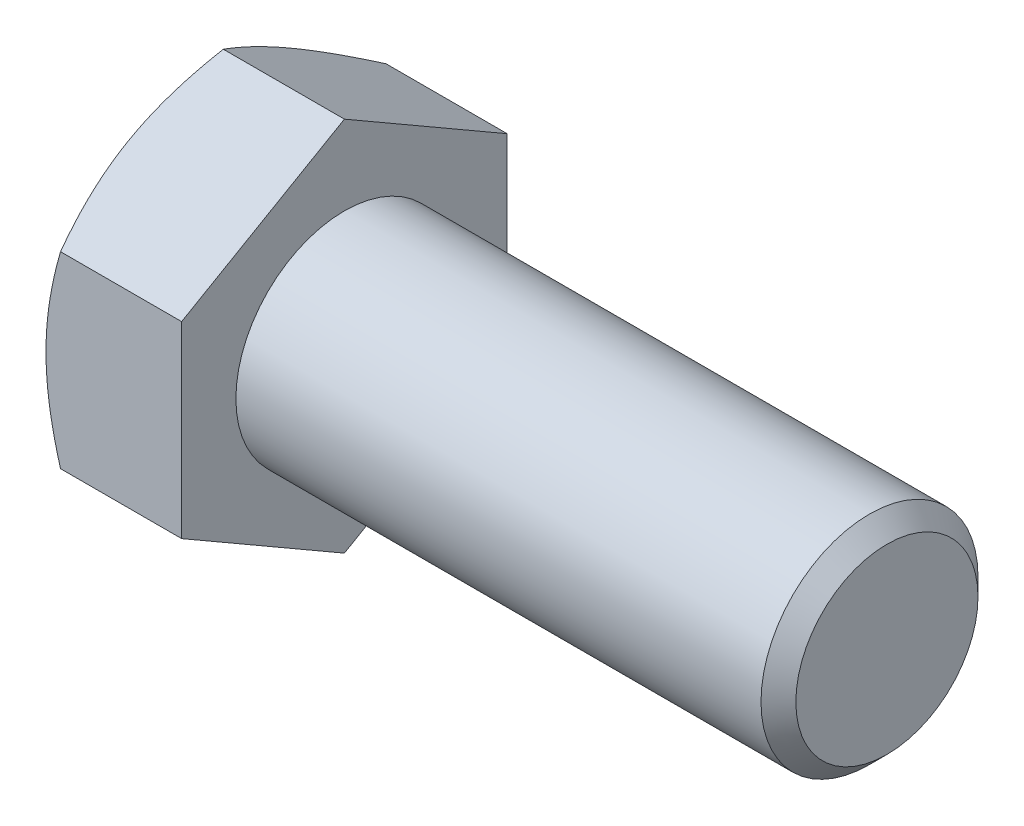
ISO-10303-21;
HEADER;
FILE_DESCRIPTION(('STEP AP214'),'2;1');
FILE_NAME('part.step','',(''),(''),'','','');
FILE_SCHEMA(('AUTOMOTIVE_DESIGN { 1 0 10303 214 1 1 1 1 }'));
ENDSEC;
DATA;
#1=APPLICATION_CONTEXT('core data for automotive mechanical design processes');
#2=APPLICATION_PROTOCOL_DEFINITION('international standard','automotive_design',2000,#1);
#3=PRODUCT_CONTEXT('',#1,'mechanical');
#4=PRODUCT('Part','Part','',(#3));
#5=PRODUCT_RELATED_PRODUCT_CATEGORY('part','',(#4));
#6=PRODUCT_DEFINITION_FORMATION('','',#4);
#7=PRODUCT_DEFINITION_CONTEXT('part definition',#1,'design');
#8=PRODUCT_DEFINITION('design','',#6,#7);
#9=PRODUCT_DEFINITION_SHAPE('','',#8);
#10=(LENGTH_UNIT() NAMED_UNIT(*) SI_UNIT(.MILLI.,.METRE.));
#11=(NAMED_UNIT(*) PLANE_ANGLE_UNIT() SI_UNIT($,.RADIAN.));
#12=(NAMED_UNIT(*) SI_UNIT($,.STERADIAN.) SOLID_ANGLE_UNIT());
#13=UNCERTAINTY_MEASURE_WITH_UNIT(LENGTH_MEASURE(1.E-05),#10,'distance_accuracy_value','');
#14=(GEOMETRIC_REPRESENTATION_CONTEXT(3) GLOBAL_UNCERTAINTY_ASSIGNED_CONTEXT((#13)) GLOBAL_UNIT_ASSIGNED_CONTEXT((#10,
#11,#12)) REPRESENTATION_CONTEXT('',''));
#15=CARTESIAN_POINT('',(0.,0.,0.));
#16=DIRECTION('',(0.,0.,1.));
#17=DIRECTION('',(1.,0.,0.));
#18=AXIS2_PLACEMENT_3D('',#15,#16,#17);
#19=CARTESIAN_POINT('',(0.,10.392304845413,0.));
#20=DIRECTION('',(1.,0.,0.));
#21=DIRECTION('',(0.,1.,0.));
#22=AXIS2_PLACEMENT_3D('',#19,#20,#21);
#23=PLANE('',#22);
#24=CARTESIAN_POINT('',(1.11022302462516E-13,0.,0.));
#25=DIRECTION('',(1.,0.,0.));
#26=DIRECTION('',(0.,1.,0.));
#27=AXIS2_PLACEMENT_3D('',#24,#25,#26);
#28=CIRCLE('',#27,9.00000000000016);
#29=CARTESIAN_POINT('',(0.,-7.79422863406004,-4.49999999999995));
#30=VERTEX_POINT('',#29);
#31=CARTESIAN_POINT('',(0.,0.,-9.00000000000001));
#32=VERTEX_POINT('',#31);
#33=EDGE_CURVE('E339',#30,#32,#28,.T.);
#34=ORIENTED_EDGE('',*,*,#33,.F.);
#35=CARTESIAN_POINT('',(0.,0.,0.));
#36=DIRECTION('',(1.,0.,0.));
#37=DIRECTION('',(0.,1.,0.));
#38=AXIS2_PLACEMENT_3D('',#35,#36,#37);
#39=CIRCLE('',#38,9.00000000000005);
#40=CARTESIAN_POINT('',(0.,-7.79422863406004,4.49999999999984));
#41=VERTEX_POINT('',#40);
#42=EDGE_CURVE('E338',#41,#30,#39,.T.);
#43=ORIENTED_EDGE('',*,*,#42,.F.);
#44=CARTESIAN_POINT('',(0.,0.,0.));
#45=DIRECTION('',(1.,0.,0.));
#46=DIRECTION('',(0.,1.,0.));
#47=AXIS2_PLACEMENT_3D('',#44,#45,#46);
#48=CIRCLE('',#47,9.00000000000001);
#49=CARTESIAN_POINT('',(-1.11022302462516E-13,-1.66533453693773E-13,8.99999999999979));
#50=VERTEX_POINT('',#49);
#51=EDGE_CURVE('E88',#50,#41,#48,.T.);
#52=ORIENTED_EDGE('',*,*,#51,.F.);
#53=CARTESIAN_POINT('',(-1.11022302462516E-13,0.,0.));
#54=DIRECTION('',(1.,0.,0.));
#55=DIRECTION('',(0.,1.,0.));
#56=AXIS2_PLACEMENT_3D('',#53,#54,#55);
#57=CIRCLE('',#56,8.9999999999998);
#58=CARTESIAN_POINT('',(-1.11022302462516E-13,7.79422863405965,4.49999999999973));
#59=VERTEX_POINT('',#58);
#60=EDGE_CURVE('E86',#59,#50,#57,.T.);
#61=ORIENTED_EDGE('',*,*,#60,.F.);
#62=CARTESIAN_POINT('',(0.,0.,0.));
#63=DIRECTION('',(1.,0.,0.));
#64=DIRECTION('',(0.,1.,0.));
#65=AXIS2_PLACEMENT_3D('',#62,#63,#64);
#66=CIRCLE('',#65,9.00000000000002);
#67=CARTESIAN_POINT('',(0.,7.79422863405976,-4.49999999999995));
#68=VERTEX_POINT('',#67);
#69=EDGE_CURVE('E19',#68,#59,#66,.T.);
#70=ORIENTED_EDGE('',*,*,#69,.F.);
#71=CARTESIAN_POINT('',(0.,0.,0.));
#72=DIRECTION('',(1.,0.,0.));
#73=DIRECTION('',(0.,1.,0.));
#74=AXIS2_PLACEMENT_3D('',#71,#72,#73);
#75=CIRCLE('',#74,9.00000000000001);
#76=EDGE_CURVE('E264',#32,#68,#75,.T.);
#77=ORIENTED_EDGE('',*,*,#76,.F.);
#78=EDGE_LOOP('',(#34,#43,#52,#61,#70,#77));
#79=FACE_BOUND('',#78,.T.);
#80=ADVANCED_FACE('F16',(#79),#23,.F.);
#81=CARTESIAN_POINT('',(0.808670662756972,0.,0.));
#82=DIRECTION('',(1.,0.,0.));
#83=DIRECTION('',(0.,1.,0.));
#84=AXIS2_PLACEMENT_3D('',#81,#82,#83);
#85=CONICAL_SURFACE('',#84,10.4006586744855,1.0471975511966);
#86=CARTESIAN_POINT('',(0.803847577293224,10.3923048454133,-4.44089209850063E-13));
#87=CARTESIAN_POINT('',(0.681717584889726,10.1808225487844,-0.366298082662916));
#88=CARTESIAN_POINT('',(0.569825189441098,9.96764662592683,-0.735529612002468));
#89=CARTESIAN_POINT('',(0.372504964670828,9.53941565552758,-1.47724741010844));
#90=CARTESIAN_POINT('',(0.286946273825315,9.32437554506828,-1.84970780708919));
#91=CARTESIAN_POINT('',(0.181894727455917,8.99978592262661,-2.41191352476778));
#92=CARTESIAN_POINT('',(0.150745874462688,8.89117935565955,-2.60002561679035));
#93=CARTESIAN_POINT('',(0.0968265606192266,8.67344627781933,-2.97715037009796));
#94=CARTESIAN_POINT('',(0.0740558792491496,8.56431978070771,-3.1661630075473));
#95=CARTESIAN_POINT('',(0.0372929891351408,8.34514319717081,-3.54578798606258));
#96=CARTESIAN_POINT('',(0.0233454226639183,8.23509122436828,-3.73640359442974));
#97=CARTESIAN_POINT('',(0.00467962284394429,8.01477084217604,-4.1180096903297));
#98=CARTESIAN_POINT('',(-3.67826645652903E-05,7.90450239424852,-4.30900024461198));
#99=CARTESIAN_POINT('',(0.,7.7942286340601,-4.50000000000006));
#100=B_SPLINE_CURVE_WITH_KNOTS('',3,(#86,#87,#88,#89,#90,#91,#92,#93,#94,#95,#96,#97,#98,#99),
.UNSPECIFIED.,.F.,.F.,(4,2,2,2,2,2,4),(0.,1.32126598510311,2.63585597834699,3.29401348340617,
3.95215366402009,4.61359774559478,5.2751727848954),.UNSPECIFIED.);
#101=CARTESIAN_POINT('',(0.803847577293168,10.3923048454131,-2.22044604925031E-13));
#102=VERTEX_POINT('',#101);
#103=EDGE_CURVE('E98',#102,#68,#100,.T.);
#104=ORIENTED_EDGE('',*,*,#103,.T.);
#105=ORIENTED_EDGE('',*,*,#69,.T.);
#106=CARTESIAN_POINT('',(-1.66533453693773E-13,7.79422863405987,4.49999999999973));
#107=CARTESIAN_POINT('',(-3.67826647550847E-05,7.90450239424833,4.30900024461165));
#108=CARTESIAN_POINT('',(0.00467962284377,8.01477084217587,4.11800969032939));
#109=CARTESIAN_POINT('',(0.0233454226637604,8.23509122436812,3.73640359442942));
#110=CARTESIAN_POINT('',(0.0372929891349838,8.34514319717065,3.54578798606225));
#111=CARTESIAN_POINT('',(0.0740558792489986,8.56431978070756,3.16616300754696));
#112=CARTESIAN_POINT('',(0.0968265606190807,8.67344627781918,2.97715037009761));
#113=CARTESIAN_POINT('',(0.150745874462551,8.89117935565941,2.60002561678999));
#114=CARTESIAN_POINT('',(0.181894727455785,8.99978592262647,2.41191352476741));
#115=CARTESIAN_POINT('',(0.286946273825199,9.32437554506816,1.84970780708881));
#116=CARTESIAN_POINT('',(0.372504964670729,9.53941565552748,1.47724741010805));
#117=CARTESIAN_POINT('',(0.569825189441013,9.96764662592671,0.735529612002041));
#118=CARTESIAN_POINT('',(0.681717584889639,10.1808225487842,0.366298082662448));
#119=CARTESIAN_POINT('',(0.803847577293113,10.392304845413,-1.11022302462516E-13));
#120=B_SPLINE_CURVE_WITH_KNOTS('',3,(#106,#107,#108,#109,#110,#111,#112,#113,#114,#115,#116,
#117,#118,#119),.UNSPECIFIED.,.F.,.F.,(4,2,2,2,2,2,4),(0.,0.66157503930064,1.32301912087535,
1.98115930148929,2.63931680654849,3.95390679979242,5.27517278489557),.UNSPECIFIED.);
#121=EDGE_CURVE('E96',#59,#102,#120,.T.);
#122=ORIENTED_EDGE('',*,*,#121,.T.);
#123=EDGE_LOOP('',(#104,#105,#122));
#124=FACE_BOUND('',#123,.T.);
#125=ADVANCED_FACE('F94',(#124),#85,.T.);
#126=CARTESIAN_POINT('',(0.808670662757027,0.,0.));
#127=DIRECTION('',(1.,0.,0.));
#128=DIRECTION('',(0.,1.,0.));
#129=AXIS2_PLACEMENT_3D('',#126,#127,#128);
#130=CONICAL_SURFACE('',#129,10.4006586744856,1.0471975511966);
#131=CARTESIAN_POINT('',(0.803847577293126,5.19615242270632,8.99999999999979));
#132=CARTESIAN_POINT('',(0.681717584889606,5.40763471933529,8.63370191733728));
#133=CARTESIAN_POINT('',(0.569825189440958,5.62081064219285,8.26447038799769));
#134=CARTESIAN_POINT('',(0.372504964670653,6.04904161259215,7.52275258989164));
#135=CARTESIAN_POINT('',(0.286946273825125,6.26408172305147,7.15029219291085));
#136=CARTESIAN_POINT('',(0.181894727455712,6.58867134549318,6.5880864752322));
#137=CARTESIAN_POINT('',(0.150745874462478,6.69727791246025,6.39997438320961));
#138=CARTESIAN_POINT('',(0.0968265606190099,6.9150109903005,6.02284962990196));
#139=CARTESIAN_POINT('',(0.0740558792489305,7.02413748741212,5.8338369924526));
#140=CARTESIAN_POINT('',(0.0372929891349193,7.24331407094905,5.45421201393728));
#141=CARTESIAN_POINT('',(0.0233454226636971,7.35336604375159,5.2635964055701));
#142=CARTESIAN_POINT('',(0.00467962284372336,7.57368642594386,4.8819903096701));
#143=CARTESIAN_POINT('',(-3.67826647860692E-05,7.68395487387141,4.69099975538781));
#144=CARTESIAN_POINT('',(-1.66533453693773E-13,7.79422863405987,4.49999999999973));
#145=B_SPLINE_CURVE_WITH_KNOTS('',3,(#131,#132,#133,#134,#135,#136,#137,#138,#139,#140,#141,
#142,#143,#144),.UNSPECIFIED.,.F.,.F.,(4,2,2,2,2,2,4),(0.,1.32126598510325,2.63585597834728,
3.29401348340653,3.95215366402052,4.61359774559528,5.27517278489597),.UNSPECIFIED.);
#146=CARTESIAN_POINT('',(0.803847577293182,5.19615242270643,9.00000000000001));
#147=VERTEX_POINT('',#146);
#148=EDGE_CURVE('E101',#147,#59,#145,.T.);
#149=ORIENTED_EDGE('',*,*,#148,.T.);
#150=ORIENTED_EDGE('',*,*,#60,.T.);
#151=CARTESIAN_POINT('',(0.,-1.66533453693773E-13,8.99999999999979));
#152=CARTESIAN_POINT('',(-3.6782664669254E-05,0.220547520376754,8.99999999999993));
#153=CARTESIAN_POINT('',(0.00467962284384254,0.441084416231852,8.99999999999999));
#154=CARTESIAN_POINT('',(0.0233454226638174,0.881725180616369,9.00000000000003));
#155=CARTESIAN_POINT('',(0.0372929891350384,1.10182912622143,9.00000000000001));
#156=CARTESIAN_POINT('',(0.0740558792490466,1.54018229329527,9.));
#157=CARTESIAN_POINT('',(0.0968265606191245,1.75843528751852,9.00000000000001));
#158=CARTESIAN_POINT('',(0.150745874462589,2.19390144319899,9.00000000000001));
#159=CARTESIAN_POINT('',(0.181894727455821,2.41111457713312,9.00000000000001));
#160=CARTESIAN_POINT('',(0.286946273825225,3.06029382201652,9.));
#161=CARTESIAN_POINT('',(0.372504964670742,3.49037404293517,9.));
#162=CARTESIAN_POINT('',(0.56982518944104,4.34683598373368,9.00000000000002));
#163=CARTESIAN_POINT('',(0.681717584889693,4.77318782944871,9.00000000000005));
#164=CARTESIAN_POINT('',(0.803847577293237,5.19615242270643,9.00000000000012));
#165=B_SPLINE_CURVE_WITH_KNOTS('',3,(#151,#152,#153,#154,#155,#156,#157,#158,#159,#160,#161,
#162,#163,#164),.UNSPECIFIED.,.F.,.F.,(4,2,2,2,2,2,4),(0.,0.661575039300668,1.32301912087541,
1.98115930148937,2.63931680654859,3.95390679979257,5.27517278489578),.UNSPECIFIED.);
#166=EDGE_CURVE('E104',#50,#147,#165,.T.);
#167=ORIENTED_EDGE('',*,*,#166,.T.);
#168=EDGE_LOOP('',(#149,#150,#167));
#169=FACE_BOUND('',#168,.T.);
#170=ADVANCED_FACE('F102',(#169),#130,.T.);
#171=CARTESIAN_POINT('',(0.808670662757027,0.,0.));
#172=DIRECTION('',(1.,0.,0.));
#173=DIRECTION('',(0.,1.,0.));
#174=AXIS2_PLACEMENT_3D('',#171,#172,#173);
#175=CONICAL_SURFACE('',#174,10.4006586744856,1.0471975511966);
#176=ORIENTED_EDGE('',*,*,#51,.T.);
#177=CARTESIAN_POINT('',(0.,-7.79422863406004,4.49999999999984));
#178=CARTESIAN_POINT('',(-3.67826645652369E-05,-7.68395487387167,4.69099975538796));
#179=CARTESIAN_POINT('',(0.00467962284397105,-7.57368642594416,4.88199030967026));
#180=CARTESIAN_POINT('',(0.0233454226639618,-7.35336604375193,5.26359640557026));
#181=CARTESIAN_POINT('',(0.0372929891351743,-7.24331407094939,5.45421201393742));
#182=CARTESIAN_POINT('',(0.0740558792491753,-7.02413748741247,5.83383699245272));
#183=CARTESIAN_POINT('',(0.0968265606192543,-6.91501099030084,6.02284962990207));
#184=CARTESIAN_POINT('',(0.150745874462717,-6.69727791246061,6.39997438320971));
#185=CARTESIAN_POINT('',(0.181894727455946,-6.58867134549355,6.58808647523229));
#186=CARTESIAN_POINT('',(0.286946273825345,-6.26408172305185,7.15029219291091));
#187=CARTESIAN_POINT('',(0.372504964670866,-6.04904161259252,7.52275258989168));
#188=CARTESIAN_POINT('',(0.569825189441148,-5.62081064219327,8.26447038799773));
#189=CARTESIAN_POINT('',(0.681717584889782,-5.40763471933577,8.63370191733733));
#190=CARTESIAN_POINT('',(0.803847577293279,-5.19615242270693,8.9999999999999));
#191=B_SPLINE_CURVE_WITH_KNOTS('',3,(#177,#178,#179,#180,#181,#182,#183,#184,#185,#186,#187,
#188,#189,#190),.UNSPECIFIED.,.F.,.F.,(4,2,2,2,2,2,4),(0.,0.661575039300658,1.32301912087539,
1.98115930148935,2.63931680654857,3.95390679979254,5.27517278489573),.UNSPECIFIED.);
#192=CARTESIAN_POINT('',(0.803847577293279,-5.19615242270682,9.00000000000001));
#193=VERTEX_POINT('',#192);
#194=EDGE_CURVE('E179',#41,#193,#191,.T.);
#195=ORIENTED_EDGE('',*,*,#194,.T.);
#196=CARTESIAN_POINT('',(0.803847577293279,-5.19615242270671,8.9999999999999));
#197=CARTESIAN_POINT('',(0.681717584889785,-4.77318782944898,8.99999999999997));
#198=CARTESIAN_POINT('',(0.569825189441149,-4.34683598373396,8.99999999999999));
#199=CARTESIAN_POINT('',(0.372504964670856,-3.49037404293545,9.00000000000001));
#200=CARTESIAN_POINT('',(0.286946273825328,-3.06029382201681,9.00000000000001));
#201=CARTESIAN_POINT('',(0.181894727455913,-2.41111457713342,9.00000000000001));
#202=CARTESIAN_POINT('',(0.150745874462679,-2.19390144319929,9.00000000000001));
#203=CARTESIAN_POINT('',(0.0968265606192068,-1.75843528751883,9.));
#204=CARTESIAN_POINT('',(0.0740558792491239,-1.54018229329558,9.));
#205=CARTESIAN_POINT('',(0.0372929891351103,-1.10182912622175,9.00000000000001));
#206=CARTESIAN_POINT('',(0.0233454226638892,-0.881725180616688,9.00000000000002));
#207=CARTESIAN_POINT('',(0.00467962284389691,-0.441084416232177,8.99999999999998));
#208=CARTESIAN_POINT('',(-3.678266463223E-05,-0.220547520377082,8.99999999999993));
#209=CARTESIAN_POINT('',(0.,-1.66533453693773E-13,8.99999999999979));
#210=B_SPLINE_CURVE_WITH_KNOTS('',3,(#196,#197,#198,#199,#200,#201,#202,#203,#204,#205,#206,
#207,#208,#209),.UNSPECIFIED.,.F.,.F.,(4,2,2,2,2,2,4),(0.,1.32126598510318,2.63585597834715,
3.29401348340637,3.95215366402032,4.61359774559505,5.27517278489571),.UNSPECIFIED.);
#211=EDGE_CURVE('E151',#193,#50,#210,.T.);
#212=ORIENTED_EDGE('',*,*,#211,.T.);
#213=EDGE_LOOP('',(#176,#195,#212));
#214=FACE_BOUND('',#213,.T.);
#215=ADVANCED_FACE('F141',(#214),#175,.T.);
#216=CARTESIAN_POINT('',(0.808670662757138,0.,0.));
#217=DIRECTION('',(1.,0.,0.));
#218=DIRECTION('',(0.,1.,0.));
#219=AXIS2_PLACEMENT_3D('',#216,#217,#218);
#220=CONICAL_SURFACE('',#219,10.4006586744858,1.0471975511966);
#221=ORIENTED_EDGE('',*,*,#42,.T.);
#222=CARTESIAN_POINT('',(0.,-7.79422863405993,-4.50000000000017));
#223=CARTESIAN_POINT('',(-3.67826646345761E-05,-7.90450239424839,-4.3090002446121));
#224=CARTESIAN_POINT('',(0.0046796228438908,-8.01477084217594,-4.11800969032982));
#225=CARTESIAN_POINT('',(0.0233454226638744,-8.2350912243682,-3.73640359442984));
#226=CARTESIAN_POINT('',(0.0372929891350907,-8.34514319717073,-3.54578798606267));
#227=CARTESIAN_POINT('',(0.0740558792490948,-8.56431978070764,-3.16616300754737));
#228=CARTESIAN_POINT('',(0.0968265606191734,-8.67344627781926,-2.97715037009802));
#229=CARTESIAN_POINT('',(0.150745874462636,-8.8911793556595,-2.60002561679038));
#230=CARTESIAN_POINT('',(0.181894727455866,-8.99978592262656,-2.4119135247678));
#231=CARTESIAN_POINT('',(0.286946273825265,-9.32437554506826,-1.84970780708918));
#232=CARTESIAN_POINT('',(0.372504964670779,-9.53941565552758,-1.47724741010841));
#233=CARTESIAN_POINT('',(0.56982518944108,-9.96764662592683,-0.735529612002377));
#234=CARTESIAN_POINT('',(0.681717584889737,-10.1808225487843,-0.366298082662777));
#235=CARTESIAN_POINT('',(0.803847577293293,-10.3923048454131,-2.22044604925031E-13));
#236=B_SPLINE_CURVE_WITH_KNOTS('',3,(#222,#223,#224,#225,#226,#227,#228,#229,#230,#231,#232,
#233,#234,#235),.UNSPECIFIED.,.F.,.F.,(4,2,2,2,2,2,4),(0.,0.661575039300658,1.32301912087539,
1.98115930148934,2.63931680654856,3.95390679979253,5.27517278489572),.UNSPECIFIED.);
#237=CARTESIAN_POINT('',(0.803847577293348,-10.3923048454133,-1.11022302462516E-13));
#238=VERTEX_POINT('',#237);
#239=EDGE_CURVE('E311',#30,#238,#236,.T.);
#240=ORIENTED_EDGE('',*,*,#239,.T.);
#241=CARTESIAN_POINT('',(0.803847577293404,-10.3923048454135,-1.11022302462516E-13));
#242=CARTESIAN_POINT('',(0.681717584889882,-10.1808225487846,0.366298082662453));
#243=CARTESIAN_POINT('',(0.569825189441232,-9.96764662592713,0.735529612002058));
#244=CARTESIAN_POINT('',(0.372504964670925,-9.53941565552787,1.4772474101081));
#245=CARTESIAN_POINT('',(0.286946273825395,-9.32437554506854,1.84970780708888));
#246=CARTESIAN_POINT('',(0.181894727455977,-8.99978592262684,2.41191352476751));
#247=CARTESIAN_POINT('',(0.150745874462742,-8.89117935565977,2.6000256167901));
#248=CARTESIAN_POINT('',(0.0968265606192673,-8.67344627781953,2.97715037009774));
#249=CARTESIAN_POINT('',(0.0740558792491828,-8.5643197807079,3.16616300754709));
#250=CARTESIAN_POINT('',(0.0372929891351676,-8.34514319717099,3.5457879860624));
#251=CARTESIAN_POINT('',(0.0233454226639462,-8.23509122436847,3.73640359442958));
#252=CARTESIAN_POINT('',(0.00467962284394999,-8.01477084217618,4.11800969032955));
#253=CARTESIAN_POINT('',(-3.67826645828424E-05,-7.90450239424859,4.30900024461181));
#254=CARTESIAN_POINT('',(0.,-7.79422863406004,4.49999999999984));
#255=B_SPLINE_CURVE_WITH_KNOTS('',3,(#241,#242,#243,#244,#245,#246,#247,#248,#249,#250,#251,
#252,#253,#254),.UNSPECIFIED.,.F.,.F.,(4,2,2,2,2,2,4),(0.,1.32126598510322,2.63585597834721,
3.29401348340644,3.95215366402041,4.61359774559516,5.27517278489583),.UNSPECIFIED.);
#256=EDGE_CURVE('E173',#238,#41,#255,.T.);
#257=ORIENTED_EDGE('',*,*,#256,.T.);
#258=EDGE_LOOP('',(#221,#240,#257));
#259=FACE_BOUND('',#258,.T.);
#260=ADVANCED_FACE('F329',(#259),#220,.T.);
#261=CARTESIAN_POINT('',(0.808670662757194,0.,0.));
#262=DIRECTION('',(1.,0.,0.));
#263=DIRECTION('',(0.,1.,0.));
#264=AXIS2_PLACEMENT_3D('',#261,#262,#263);
#265=CONICAL_SURFACE('',#264,10.4006586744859,1.0471975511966);
#266=ORIENTED_EDGE('',*,*,#33,.T.);
#267=CARTESIAN_POINT('',(0.,-1.11022302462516E-13,-9.00000000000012));
#268=CARTESIAN_POINT('',(-3.67826644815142E-05,-0.220547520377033,-9.00000000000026));
#269=CARTESIAN_POINT('',(0.00467962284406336,-0.441084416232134,-9.00000000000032));
#270=CARTESIAN_POINT('',(0.0233454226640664,-0.881725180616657,-9.00000000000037));
#271=CARTESIAN_POINT('',(0.0372929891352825,-1.10182912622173,-9.00000000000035));
#272=CARTESIAN_POINT('',(0.0740558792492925,-1.54018229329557,-9.00000000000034));
#273=CARTESIAN_POINT('',(0.0968265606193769,-1.75843528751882,-9.00000000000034));
#274=CARTESIAN_POINT('',(0.15074587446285,-2.19390144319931,-9.00000000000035));
#275=CARTESIAN_POINT('',(0.181894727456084,-2.41111457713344,-9.00000000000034));
#276=CARTESIAN_POINT('',(0.286946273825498,-3.06029382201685,-9.00000000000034));
#277=CARTESIAN_POINT('',(0.372504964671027,-3.49037404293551,-9.00000000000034));
#278=CARTESIAN_POINT('',(0.569825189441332,-4.34683598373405,-9.00000000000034));
#279=CARTESIAN_POINT('',(0.681717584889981,-4.77318782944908,-9.00000000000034));
#280=CARTESIAN_POINT('',(0.803847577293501,-5.19615242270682,-9.00000000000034));
#281=B_SPLINE_CURVE_WITH_KNOTS('',3,(#267,#268,#269,#270,#271,#272,#273,#274,#275,#276,#277,
#278,#279,#280),.UNSPECIFIED.,.F.,.F.,(4,2,2,2,2,2,4),(0.,0.661575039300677,1.32301912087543,
1.9811593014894,2.63931680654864,3.95390679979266,5.27517278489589),.UNSPECIFIED.);
#282=CARTESIAN_POINT('',(0.803847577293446,-5.19615242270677,-9.00000000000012));
#283=VERTEX_POINT('',#282);
#284=EDGE_CURVE('E240',#32,#283,#281,.T.);
#285=ORIENTED_EDGE('',*,*,#284,.T.);
#286=CARTESIAN_POINT('',(0.803847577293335,-5.19615242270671,-9.00000000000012));
#287=CARTESIAN_POINT('',(0.681717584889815,-5.40763471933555,-8.63370191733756));
#288=CARTESIAN_POINT('',(0.569825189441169,-5.62081064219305,-8.26447038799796));
#289=CARTESIAN_POINT('',(0.37250496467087,-6.04904161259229,-7.52275258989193));
#290=CARTESIAN_POINT('',(0.286946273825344,-6.26408172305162,-7.15029219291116));
#291=CARTESIAN_POINT('',(0.181894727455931,-6.58867134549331,-6.58808647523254));
#292=CARTESIAN_POINT('',(0.150745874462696,-6.69727791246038,-6.39997438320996));
#293=CARTESIAN_POINT('',(0.0968265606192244,-6.91501099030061,-6.02284962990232));
#294=CARTESIAN_POINT('',(0.0740558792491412,-7.02413748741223,-5.83383699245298));
#295=CARTESIAN_POINT('',(0.0372929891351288,-7.24331407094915,-5.45421201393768));
#296=CARTESIAN_POINT('',(0.023345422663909,-7.35336604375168,-5.2635964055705));
#297=CARTESIAN_POINT('',(0.00467962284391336,-7.57368642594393,-4.88199030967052));
#298=CARTESIAN_POINT('',(-3.67826646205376E-05,-7.68395487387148,-4.69099975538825));
#299=CARTESIAN_POINT('',(0.,-7.79422863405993,-4.50000000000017));
#300=B_SPLINE_CURVE_WITH_KNOTS('',3,(#286,#287,#288,#289,#290,#291,#292,#293,#294,#295,#296,
#297,#298,#299),.UNSPECIFIED.,.F.,.F.,(4,2,2,2,2,2,4),(0.,1.32126598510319,2.63585597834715,
3.29401348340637,3.95215366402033,4.61359774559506,5.27517278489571),.UNSPECIFIED.);
#301=EDGE_CURVE('E310',#283,#30,#300,.T.);
#302=ORIENTED_EDGE('',*,*,#301,.T.);
#303=EDGE_LOOP('',(#266,#285,#302));
#304=FACE_BOUND('',#303,.T.);
#305=ADVANCED_FACE('F255',(#304),#265,.T.);
#306=CARTESIAN_POINT('',(0.808670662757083,0.,0.));
#307=DIRECTION('',(1.,0.,0.));
#308=DIRECTION('',(0.,1.,0.));
#309=AXIS2_PLACEMENT_3D('',#306,#307,#308);
#310=CONICAL_SURFACE('',#309,10.4006586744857,1.0471975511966);
#311=CARTESIAN_POINT('',(0.803847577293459,5.19615242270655,-9.00000000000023));
#312=CARTESIAN_POINT('',(0.681717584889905,4.77318782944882,-9.0000000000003));
#313=CARTESIAN_POINT('',(0.569825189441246,4.34683598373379,-9.00000000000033));
#314=CARTESIAN_POINT('',(0.372504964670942,3.49037404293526,-9.00000000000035));
#315=CARTESIAN_POINT('',(0.286946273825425,3.0602938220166,-9.00000000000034));
#316=CARTESIAN_POINT('',(0.181894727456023,2.41111457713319,-9.00000000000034));
#317=CARTESIAN_POINT('',(0.150745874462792,2.19390144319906,-9.00000000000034));
#318=CARTESIAN_POINT('',(0.0968265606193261,1.75843528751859,-9.00000000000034));
#319=CARTESIAN_POINT('',(0.0740558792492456,1.54018229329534,-9.00000000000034));
#320=CARTESIAN_POINT('',(0.0372929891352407,1.1018291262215,-9.00000000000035));
#321=CARTESIAN_POINT('',(0.0233454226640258,0.881725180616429,-9.00000000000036));
#322=CARTESIAN_POINT('',(0.00467962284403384,0.441084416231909,-9.00000000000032));
#323=CARTESIAN_POINT('',(-3.67826645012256E-05,0.220547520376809,-9.00000000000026));
#324=CARTESIAN_POINT('',(0.,-1.11022302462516E-13,-9.00000000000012));
#325=B_SPLINE_CURVE_WITH_KNOTS('',3,(#311,#312,#313,#314,#315,#316,#317,#318,#319,#320,#321,
#322,#323,#324),.UNSPECIFIED.,.F.,.F.,(4,2,2,2,2,2,4),(0.,1.32126598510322,2.63585597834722,
3.29401348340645,3.95215366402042,4.61359774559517,5.27517278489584),.UNSPECIFIED.);
#326=CARTESIAN_POINT('',(0.803847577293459,5.1961524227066,-9.00000000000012));
#327=VERTEX_POINT('',#326);
#328=EDGE_CURVE('E231',#327,#32,#325,.T.);
#329=ORIENTED_EDGE('',*,*,#328,.T.);
#330=ORIENTED_EDGE('',*,*,#76,.T.);
#331=CARTESIAN_POINT('',(0.,7.7942286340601,-4.50000000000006));
#332=CARTESIAN_POINT('',(-3.67826645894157E-05,7.6839548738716,-4.69099975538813));
#333=CARTESIAN_POINT('',(0.00467962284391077,7.57368642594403,-4.88199030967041));
#334=CARTESIAN_POINT('',(0.0233454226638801,7.35336604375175,-5.2635964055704));
#335=CARTESIAN_POINT('',(0.0372929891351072,7.24331407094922,-5.45421201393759));
#336=CARTESIAN_POINT('',(0.0740558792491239,7.0241374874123,-5.83383699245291));
#337=CARTESIAN_POINT('',(0.0968265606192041,6.91501099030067,-6.02284962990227));
#338=CARTESIAN_POINT('',(0.150745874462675,6.69727791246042,-6.39997438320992));
#339=CARTESIAN_POINT('',(0.181894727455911,6.58867134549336,-6.58808647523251));
#340=CARTESIAN_POINT('',(0.286946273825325,6.26408172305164,-7.15029219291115));
#341=CARTESIAN_POINT('',(0.372504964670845,6.04904161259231,-7.52275258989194));
#342=CARTESIAN_POINT('',(0.569825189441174,5.62081064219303,-8.264470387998));
#343=CARTESIAN_POINT('',(0.681717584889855,5.4076347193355,-8.63370191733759));
#344=CARTESIAN_POINT('',(0.803847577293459,5.1961524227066,-9.00000000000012));
#345=B_SPLINE_CURVE_WITH_KNOTS('',3,(#331,#332,#333,#334,#335,#336,#337,#338,#339,#340,#341,
#342,#343,#344),.UNSPECIFIED.,.F.,.F.,(4,2,2,2,2,2,4),(0.,0.661575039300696,1.32301912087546,
1.98115930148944,2.63931680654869,3.95390679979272,5.27517278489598),.UNSPECIFIED.);
#346=EDGE_CURVE('E114',#68,#327,#345,.T.);
#347=ORIENTED_EDGE('',*,*,#346,.T.);
#348=EDGE_LOOP('',(#329,#330,#347));
#349=FACE_BOUND('',#348,.T.);
#350=ADVANCED_FACE('F250',(#349),#310,.T.);
#351=CARTESIAN_POINT('',(37.5000000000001,-1.11022302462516E-13,-2.22044604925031E-13));
#352=DIRECTION('',(-1.,0.,0.));
#353=DIRECTION('',(0.,-1.,0.));
#354=AXIS2_PLACEMENT_3D('',#351,#352,#353);
#355=PLANE('',#354);
#356=CARTESIAN_POINT('',(37.4999999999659,0.,1.11022302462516E-13));
#357=DIRECTION('',(-1.,0.,0.));
#358=DIRECTION('',(0.,0.,1.));
#359=AXIS2_PLACEMENT_3D('',#356,#357,#358);
#360=CIRCLE('',#359,5.03600000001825);
#361=CARTESIAN_POINT('',(37.4999999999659,0.,5.03600000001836));
#362=VERTEX_POINT('',#361);
#363=EDGE_CURVE('E202',#362,#362,#360,.T.);
#364=ORIENTED_EDGE('',*,*,#363,.F.);
#365=EDGE_LOOP('',(#364));
#366=FACE_BOUND('',#365,.T.);
#367=ADVANCED_FACE('F254',(#366),#355,.F.);
#368=CARTESIAN_POINT('',(7.4999999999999,5.19615242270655,-9.00000000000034));
#369=DIRECTION('',(0.,-0.866025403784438,0.500000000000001));
#370=DIRECTION('',(0.,-0.500000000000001,-0.866025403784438));
#371=AXIS2_PLACEMENT_3D('',#368,#369,#370);
#372=PLANE('',#371);
#373=DIRECTION('',(1.,0.,0.));
#374=VECTOR('',#373,1.);
#375=CARTESIAN_POINT('',(7.49999999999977,10.392304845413,0.));
#376=LINE('',#375,#374);
#377=CARTESIAN_POINT('',(7.49999999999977,10.392304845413,0.));
#378=VERTEX_POINT('',#377);
#379=EDGE_CURVE('E107',#102,#378,#376,.T.);
#380=ORIENTED_EDGE('',*,*,#379,.T.);
#381=DIRECTION('',(0.,0.499999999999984,0.866025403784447));
#382=VECTOR('',#381,1.);
#383=CARTESIAN_POINT('',(7.4999999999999,5.19615242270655,-9.00000000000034));
#384=LINE('',#383,#382);
#385=CARTESIAN_POINT('',(7.4999999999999,5.19615242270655,-9.00000000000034));
#386=VERTEX_POINT('',#385);
#387=EDGE_CURVE('E198',#386,#378,#384,.T.);
#388=ORIENTED_EDGE('',*,*,#387,.F.);
#389=DIRECTION('',(1.,0.,0.));
#390=VECTOR('',#389,1.);
#391=CARTESIAN_POINT('',(7.4999999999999,5.19615242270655,-9.00000000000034));
#392=LINE('',#391,#390);
#393=EDGE_CURVE('E239',#386,#327,#392,.F.);
#394=ORIENTED_EDGE('',*,*,#393,.T.);
#395=ORIENTED_EDGE('',*,*,#346,.F.);
#396=ORIENTED_EDGE('',*,*,#103,.F.);
#397=EDGE_LOOP('',(#380,#388,#394,#395,#396));
#398=FACE_BOUND('',#397,.T.);
#399=ADVANCED_FACE('F266',(#398),#372,.F.);
#400=CARTESIAN_POINT('',(7.49999999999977,10.392304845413,0.));
#401=DIRECTION('',(0.,-0.866025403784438,-0.5));
#402=DIRECTION('',(0.,0.5,-0.866025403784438));
#403=AXIS2_PLACEMENT_3D('',#400,#401,#402);
#404=PLANE('',#403);
#405=DIRECTION('',(1.,0.,0.));
#406=VECTOR('',#405,1.);
#407=CARTESIAN_POINT('',(7.49999999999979,5.19615242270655,9.00000000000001));
#408=LINE('',#407,#406);
#409=CARTESIAN_POINT('',(7.49999999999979,5.19615242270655,9.00000000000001));
#410=VERTEX_POINT('',#409);
#411=EDGE_CURVE('E150',#147,#410,#408,.T.);
#412=ORIENTED_EDGE('',*,*,#411,.T.);
#413=DIRECTION('',(0.,-0.499999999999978,0.866025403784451));
#414=VECTOR('',#413,1.);
#415=CARTESIAN_POINT('',(7.49999999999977,10.392304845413,0.));
#416=LINE('',#415,#414);
#417=EDGE_CURVE('E201',#378,#410,#416,.T.);
#418=ORIENTED_EDGE('',*,*,#417,.F.);
#419=ORIENTED_EDGE('',*,*,#379,.F.);
#420=ORIENTED_EDGE('',*,*,#121,.F.);
#421=ORIENTED_EDGE('',*,*,#148,.F.);
#422=EDGE_LOOP('',(#412,#418,#419,#420,#421));
#423=FACE_BOUND('',#422,.T.);
#424=ADVANCED_FACE('F110',(#423),#404,.F.);
#425=CARTESIAN_POINT('',(7.49999999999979,5.19615242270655,9.00000000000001));
#426=DIRECTION('',(0.,0.,-1.));
#427=DIRECTION('',(0.,1.,0.));
#428=AXIS2_PLACEMENT_3D('',#425,#426,#427);
#429=PLANE('',#428);
#430=DIRECTION('',(1.,0.,0.));
#431=VECTOR('',#430,1.);
#432=CARTESIAN_POINT('',(7.49999999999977,-5.19615242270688,8.99999999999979));
#433=LINE('',#432,#431);
#434=CARTESIAN_POINT('',(7.49999999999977,-5.19615242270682,8.9999999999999));
#435=VERTEX_POINT('',#434);
#436=EDGE_CURVE('E184',#193,#435,#433,.T.);
#437=ORIENTED_EDGE('',*,*,#436,.T.);
#438=DIRECTION('',(0.,1.,0.));
#439=VECTOR('',#438,1.);
#440=CARTESIAN_POINT('',(7.49999999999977,10.392304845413,9.00000000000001));
#441=LINE('',#440,#439);
#442=EDGE_CURVE('E218',#410,#435,#441,.F.);
#443=ORIENTED_EDGE('',*,*,#442,.F.);
#444=ORIENTED_EDGE('',*,*,#411,.F.);
#445=ORIENTED_EDGE('',*,*,#166,.F.);
#446=ORIENTED_EDGE('',*,*,#211,.F.);
#447=EDGE_LOOP('',(#437,#443,#444,#445,#446));
#448=FACE_BOUND('',#447,.T.);
#449=ADVANCED_FACE('F157',(#448),#429,.F.);
#450=CARTESIAN_POINT('',(7.49999999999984,-10.3923048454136,-2.22044604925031E-13));
#451=DIRECTION('',(0.,0.866025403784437,-0.500000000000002));
#452=DIRECTION('',(0.,0.500000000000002,0.866025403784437));
#453=AXIS2_PLACEMENT_3D('',#450,#451,#452);
#454=PLANE('',#453);
#455=DIRECTION('',(1.,0.,0.));
#456=VECTOR('',#455,1.);
#457=CARTESIAN_POINT('',(7.49999999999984,-10.3923048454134,0.));
#458=LINE('',#457,#456);
#459=CARTESIAN_POINT('',(7.49999999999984,-10.3923048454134,0.));
#460=VERTEX_POINT('',#459);
#461=EDGE_CURVE('E308',#238,#460,#458,.T.);
#462=ORIENTED_EDGE('',*,*,#461,.T.);
#463=DIRECTION('',(0.,-0.500000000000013,-0.86602540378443));
#464=VECTOR('',#463,1.);
#465=CARTESIAN_POINT('',(7.49999999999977,-5.19615242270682,8.9999999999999));
#466=LINE('',#465,#464);
#467=EDGE_CURVE('E213',#435,#460,#466,.T.);
#468=ORIENTED_EDGE('',*,*,#467,.F.);
#469=ORIENTED_EDGE('',*,*,#436,.F.);
#470=ORIENTED_EDGE('',*,*,#194,.F.);
#471=ORIENTED_EDGE('',*,*,#256,.F.);
#472=EDGE_LOOP('',(#462,#468,#469,#470,#471));
#473=FACE_BOUND('',#472,.T.);
#474=ADVANCED_FACE('F161',(#473),#454,.F.);
#475=CARTESIAN_POINT('',(7.49999999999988,-5.19615242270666,-9.00000000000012));
#476=DIRECTION('',(0.,0.866025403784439,0.499999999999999));
#477=DIRECTION('',(0.,-0.499999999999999,0.866025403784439));
#478=AXIS2_PLACEMENT_3D('',#475,#476,#477);
#479=PLANE('',#478);
#480=DIRECTION('',(1.,0.,0.));
#481=VECTOR('',#480,1.);
#482=CARTESIAN_POINT('',(7.49999999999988,-5.19615242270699,-9.00000000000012));
#483=LINE('',#482,#481);
#484=CARTESIAN_POINT('',(7.49999999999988,-5.19615242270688,-9.00000000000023));
#485=VERTEX_POINT('',#484);
#486=EDGE_CURVE('E34',#283,#485,#483,.T.);
#487=ORIENTED_EDGE('',*,*,#486,.T.);
#488=DIRECTION('',(0.,0.500000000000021,-0.866025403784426));
#489=VECTOR('',#488,1.);
#490=CARTESIAN_POINT('',(7.49999999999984,-10.3923048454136,-2.22044604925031E-13));
#491=LINE('',#490,#489);
#492=EDGE_CURVE('E208',#460,#485,#491,.T.);
#493=ORIENTED_EDGE('',*,*,#492,.F.);
#494=ORIENTED_EDGE('',*,*,#461,.F.);
#495=ORIENTED_EDGE('',*,*,#239,.F.);
#496=ORIENTED_EDGE('',*,*,#301,.F.);
#497=EDGE_LOOP('',(#487,#493,#494,#495,#496));
#498=FACE_BOUND('',#497,.T.);
#499=ADVANCED_FACE('F167',(#498),#479,.F.);
#500=CARTESIAN_POINT('',(7.4999999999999,5.19615242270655,-9.00000000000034));
#501=DIRECTION('',(0.,0.,1.));
#502=DIRECTION('',(0.,-1.,0.));
#503=AXIS2_PLACEMENT_3D('',#500,#501,#502);
#504=PLANE('',#503);
#505=ORIENTED_EDGE('',*,*,#393,.F.);
#506=DIRECTION('',(0.,1.,0.));
#507=VECTOR('',#506,1.);
#508=CARTESIAN_POINT('',(7.49999999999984,10.392304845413,-8.9999999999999));
#509=LINE('',#508,#507);
#510=EDGE_CURVE('E205',#485,#386,#509,.T.);
#511=ORIENTED_EDGE('',*,*,#510,.F.);
#512=ORIENTED_EDGE('',*,*,#486,.F.);
#513=ORIENTED_EDGE('',*,*,#284,.F.);
#514=ORIENTED_EDGE('',*,*,#328,.F.);
#515=EDGE_LOOP('',(#505,#511,#512,#513,#514));
#516=FACE_BOUND('',#515,.T.);
#517=ADVANCED_FACE('F247',(#516),#504,.F.);
#518=CARTESIAN_POINT('',(36.536000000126,0.,1.11022302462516E-13));
#519=DIRECTION('',(-1.,0.,0.));
#520=DIRECTION('',(0.,0.,1.));
#521=AXIS2_PLACEMENT_3D('',#518,#519,#520);
#522=CONICAL_SURFACE('',#521,5.99999999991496,0.785398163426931);
#523=ORIENTED_EDGE('',*,*,#363,.T.);
#524=EDGE_LOOP('',(#523));
#525=FACE_BOUND('',#524,.T.);
#526=CARTESIAN_POINT('',(36.5359999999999,0.,1.11022302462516E-13));
#527=DIRECTION('',(-1.,0.,0.));
#528=DIRECTION('',(0.,-1.,0.));
#529=AXIS2_PLACEMENT_3D('',#526,#527,#528);
#530=CIRCLE('',#529,6.00000000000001);
#531=CARTESIAN_POINT('',(36.5359999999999,-6.00000000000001,1.11022302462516E-13));
#532=VERTEX_POINT('',#531);
#533=EDGE_CURVE('E25',#532,#532,#530,.T.);
#534=ORIENTED_EDGE('',*,*,#533,.F.);
#535=EDGE_LOOP('',(#534));
#536=FACE_BOUND('',#535,.T.);
#537=ADVANCED_FACE('F285',(#525,#536),#522,.T.);
#538=CARTESIAN_POINT('',(7.49999999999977,10.392304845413,0.));
#539=DIRECTION('',(1.,0.,0.));
#540=DIRECTION('',(0.,1.,0.));
#541=AXIS2_PLACEMENT_3D('',#538,#539,#540);
#542=PLANE('',#541);
#543=ORIENTED_EDGE('',*,*,#492,.T.);
#544=ORIENTED_EDGE('',*,*,#510,.T.);
#545=ORIENTED_EDGE('',*,*,#387,.T.);
#546=ORIENTED_EDGE('',*,*,#417,.T.);
#547=ORIENTED_EDGE('',*,*,#442,.T.);
#548=ORIENTED_EDGE('',*,*,#467,.T.);
#549=EDGE_LOOP('',(#543,#544,#545,#546,#547,#548));
#550=FACE_BOUND('',#549,.T.);
#551=CARTESIAN_POINT('',(7.49999999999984,0.,1.11022302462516E-13));
#552=DIRECTION('',(-1.,0.,0.));
#553=DIRECTION('',(0.,-1.,0.));
#554=AXIS2_PLACEMENT_3D('',#551,#552,#553);
#555=CIRCLE('',#554,6.00000000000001);
#556=CARTESIAN_POINT('',(7.49999999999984,-6.00000000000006,1.11022302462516E-13));
#557=VERTEX_POINT('',#556);
#558=EDGE_CURVE('E11',#557,#557,#555,.F.);
#559=ORIENTED_EDGE('',*,*,#558,.F.);
#560=EDGE_LOOP('',(#559));
#561=FACE_BOUND('',#560,.T.);
#562=ADVANCED_FACE('F279',(#550,#561),#542,.T.);
#563=CARTESIAN_POINT('',(0.,0.,0.));
#564=DIRECTION('',(-1.,0.,0.));
#565=DIRECTION('',(0.,-1.,0.));
#566=AXIS2_PLACEMENT_3D('',#563,#564,#565);
#567=CYLINDRICAL_SURFACE('',#566,6.00000000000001);
#568=ORIENTED_EDGE('',*,*,#533,.T.);
#569=EDGE_LOOP('',(#568));
#570=FACE_BOUND('',#569,.T.);
#571=ORIENTED_EDGE('',*,*,#558,.T.);
#572=EDGE_LOOP('',(#571));
#573=FACE_BOUND('',#572,.T.);
#574=ADVANCED_FACE('F277',(#570,#573),#567,.T.);
#575=CLOSED_SHELL('',(#80,#125,#170,#215,#260,#305,#350,#367,#399,#424,#449,#474,#499,#517,#537,
#562,#574));
#576=MANIFOLD_SOLID_BREP('B1',#575);
#577=ADVANCED_BREP_SHAPE_REPRESENTATION('',(#18,#576),#14);
#578=SHAPE_DEFINITION_REPRESENTATION(#9,#577);
ENDSEC;
END-ISO-10303-21;
